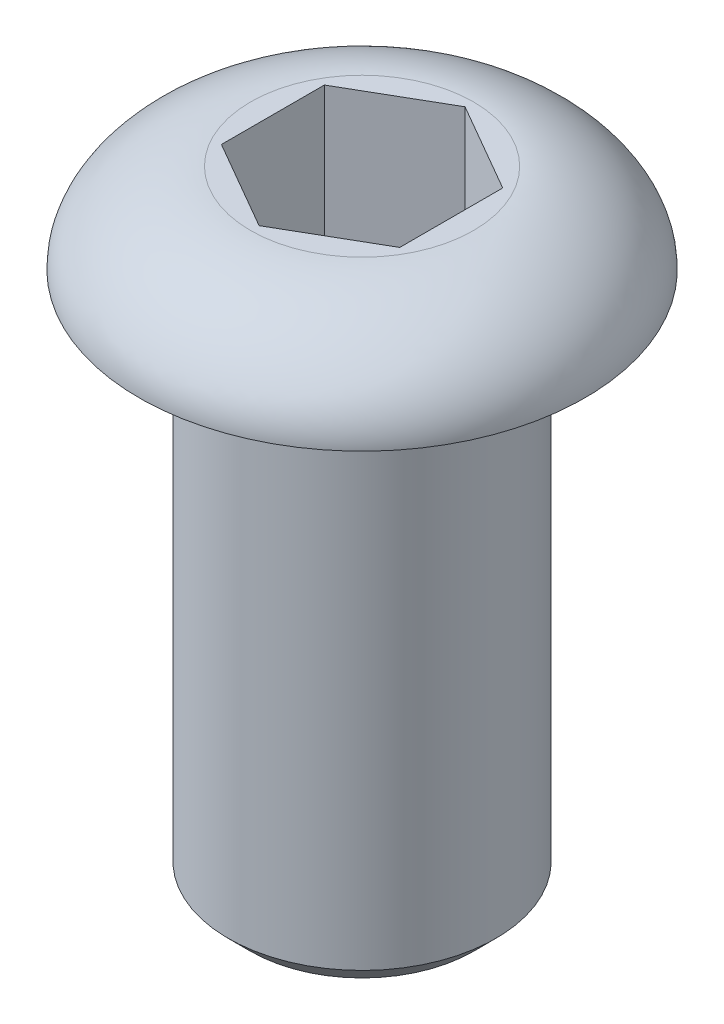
ISO-10303-21;
HEADER;
FILE_DESCRIPTION(('STEP AP214'),'2;1');
FILE_NAME('part.step','',(''),(''),'','','');
FILE_SCHEMA(('AUTOMOTIVE_DESIGN { 1 0 10303 214 1 1 1 1 }'));
ENDSEC;
DATA;
#1=APPLICATION_CONTEXT('core data for automotive mechanical design processes');
#2=APPLICATION_PROTOCOL_DEFINITION('international standard','automotive_design',2000,#1);
#3=PRODUCT_CONTEXT('',#1,'mechanical');
#4=PRODUCT('Part','Part','',(#3));
#5=PRODUCT_RELATED_PRODUCT_CATEGORY('part','',(#4));
#6=PRODUCT_DEFINITION_FORMATION('','',#4);
#7=PRODUCT_DEFINITION_CONTEXT('part definition',#1,'design');
#8=PRODUCT_DEFINITION('design','',#6,#7);
#9=PRODUCT_DEFINITION_SHAPE('','',#8);
#10=(LENGTH_UNIT() NAMED_UNIT(*) SI_UNIT(.MILLI.,.METRE.));
#11=(NAMED_UNIT(*) PLANE_ANGLE_UNIT() SI_UNIT($,.RADIAN.));
#12=(NAMED_UNIT(*) SI_UNIT($,.STERADIAN.) SOLID_ANGLE_UNIT());
#13=UNCERTAINTY_MEASURE_WITH_UNIT(LENGTH_MEASURE(1.E-05),#10,'distance_accuracy_value','');
#14=(GEOMETRIC_REPRESENTATION_CONTEXT(3) GLOBAL_UNCERTAINTY_ASSIGNED_CONTEXT((#13)) GLOBAL_UNIT_ASSIGNED_CONTEXT((#10,
#11,#12)) REPRESENTATION_CONTEXT('',''));
#15=CARTESIAN_POINT('',(0.,0.,0.));
#16=DIRECTION('',(0.,0.,1.));
#17=DIRECTION('',(1.,0.,0.));
#18=AXIS2_PLACEMENT_3D('',#15,#16,#17);
#19=CARTESIAN_POINT('',(0.,-12.,0.));
#20=DIRECTION('',(0.,1.,0.));
#21=DIRECTION('',(-1.,0.,0.));
#22=AXIS2_PLACEMENT_3D('',#19,#20,#21);
#23=PLANE('',#22);
#24=CARTESIAN_POINT('',(0.,-12.,0.));
#25=DIRECTION('',(0.,1.,0.));
#26=DIRECTION('',(-1.,0.,0.));
#27=AXIS2_PLACEMENT_3D('',#24,#25,#26);
#28=CIRCLE('',#27,2.5);
#29=CARTESIAN_POINT('',(-2.5,-12.,0.));
#30=VERTEX_POINT('',#29);
#31=EDGE_CURVE('E11',#30,#30,#28,.T.);
#32=ORIENTED_EDGE('',*,*,#31,.F.);
#33=EDGE_LOOP('',(#32));
#34=FACE_BOUND('',#33,.T.);
#35=ADVANCED_FACE('F46',(#34),#23,.F.);
#36=CARTESIAN_POINT('',(0.,-12.,0.));
#37=DIRECTION('',(0.,1.,0.));
#38=DIRECTION('',(-1.,0.,0.));
#39=AXIS2_PLACEMENT_3D('',#36,#37,#38);
#40=CONICAL_SURFACE('',#39,2.5,0.785398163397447);
#41=CARTESIAN_POINT('',(0.,-11.5,0.));
#42=DIRECTION('',(0.,1.,0.));
#43=DIRECTION('',(-1.,0.,0.));
#44=AXIS2_PLACEMENT_3D('',#41,#42,#43);
#45=CIRCLE('',#44,3.);
#46=CARTESIAN_POINT('',(-3.,-11.5,0.));
#47=VERTEX_POINT('',#46);
#48=EDGE_CURVE('E54',#47,#47,#45,.T.);
#49=ORIENTED_EDGE('',*,*,#48,.F.);
#50=EDGE_LOOP('',(#49));
#51=FACE_BOUND('',#50,.T.);
#52=ORIENTED_EDGE('',*,*,#31,.T.);
#53=EDGE_LOOP('',(#52));
#54=FACE_BOUND('',#53,.T.);
#55=ADVANCED_FACE('F196',(#51,#54),#40,.T.);
#56=CARTESIAN_POINT('',(0.,2.,0.));
#57=DIRECTION('',(0.,1.,0.));
#58=DIRECTION('',(-1.,0.,0.));
#59=AXIS2_PLACEMENT_3D('',#56,#57,#58);
#60=CYLINDRICAL_SURFACE('',#59,3.);
#61=CARTESIAN_POINT('',(0.,0.,0.));
#62=DIRECTION('',(0.,1.,0.));
#63=DIRECTION('',(-1.,0.,0.));
#64=AXIS2_PLACEMENT_3D('',#61,#62,#63);
#65=CIRCLE('',#64,3.);
#66=CARTESIAN_POINT('',(-3.,0.,0.));
#67=VERTEX_POINT('',#66);
#68=EDGE_CURVE('E210',#67,#67,#65,.T.);
#69=ORIENTED_EDGE('',*,*,#68,.F.);
#70=EDGE_LOOP('',(#69));
#71=FACE_BOUND('',#70,.T.);
#72=ORIENTED_EDGE('',*,*,#48,.T.);
#73=EDGE_LOOP('',(#72));
#74=FACE_BOUND('',#73,.T.);
#75=ADVANCED_FACE('F193',(#71,#74),#60,.T.);
#76=CARTESIAN_POINT('',(3.,0.,0.));
#77=DIRECTION('',(0.,1.,0.));
#78=DIRECTION('',(-1.,0.,0.));
#79=AXIS2_PLACEMENT_3D('',#76,#77,#78);
#80=PLANE('',#79);
#81=CARTESIAN_POINT('',(0.,0.,0.));
#82=DIRECTION('',(0.,1.,0.));
#83=DIRECTION('',(-1.,0.,0.));
#84=AXIS2_PLACEMENT_3D('',#81,#82,#83);
#85=CIRCLE('',#84,5.);
#86=CARTESIAN_POINT('',(-5.,0.,0.));
#87=VERTEX_POINT('',#86);
#88=EDGE_CURVE('E215',#87,#87,#85,.T.);
#89=ORIENTED_EDGE('',*,*,#88,.F.);
#90=EDGE_LOOP('',(#89));
#91=FACE_BOUND('',#90,.T.);
#92=ORIENTED_EDGE('',*,*,#68,.T.);
#93=EDGE_LOOP('',(#92));
#94=FACE_BOUND('',#93,.T.);
#95=ADVANCED_FACE('F188',(#91,#94),#80,.F.);
#96=CARTESIAN_POINT('',(5.,0.,0.));
#97=CARTESIAN_POINT('',(5.,1.06718737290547,0.));
#98=CARTESIAN_POINT('',(3.56718737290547,2.,0.));
#99=CARTESIAN_POINT('',(2.5,2.,0.));
#100=B_SPLINE_CURVE_WITH_KNOTS('',3,(#96,#97,#98,#99),.UNSPECIFIED.,.F.,.F.,(4,4),(0.,1.),.UNSPECIFIED.);
#101=CARTESIAN_POINT('',(0.,2.,0.));
#102=DIRECTION('',(0.,1.,0.));
#103=AXIS1_PLACEMENT('',#101,#102);
#104=SURFACE_OF_REVOLUTION('',#100,#103);
#105=CARTESIAN_POINT('',(0.,2.,0.));
#106=DIRECTION('',(0.,1.,0.));
#107=DIRECTION('',(-1.,0.,0.));
#108=AXIS2_PLACEMENT_3D('',#105,#106,#107);
#109=CIRCLE('',#108,2.5);
#110=CARTESIAN_POINT('',(-2.5,2.,0.));
#111=VERTEX_POINT('',#110);
#112=EDGE_CURVE('E164',#111,#111,#109,.T.);
#113=ORIENTED_EDGE('',*,*,#112,.F.);
#114=EDGE_LOOP('',(#113));
#115=FACE_BOUND('',#114,.T.);
#116=ORIENTED_EDGE('',*,*,#88,.T.);
#117=EDGE_LOOP('',(#116));
#118=FACE_BOUND('',#117,.T.);
#119=ADVANCED_FACE('F184',(#115,#118),#104,.T.);
#120=CARTESIAN_POINT('',(0.,2.,0.));
#121=DIRECTION('',(0.,-1.,0.));
#122=DIRECTION('',(1.,0.,0.));
#123=AXIS2_PLACEMENT_3D('',#120,#121,#122);
#124=PLANE('',#123);
#125=DIRECTION('',(0.866025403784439,0.,-0.5));
#126=VECTOR('',#125,1.);
#127=CARTESIAN_POINT('',(0.,2.,2.3094010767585));
#128=LINE('',#127,#126);
#129=CARTESIAN_POINT('',(0.,2.,2.3094010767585));
#130=VERTEX_POINT('',#129);
#131=CARTESIAN_POINT('',(2.,2.,1.15470053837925));
#132=VERTEX_POINT('',#131);
#133=EDGE_CURVE('E116',#130,#132,#128,.T.);
#134=ORIENTED_EDGE('',*,*,#133,.F.);
#135=DIRECTION('',(0.866025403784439,0.,0.5));
#136=VECTOR('',#135,1.);
#137=CARTESIAN_POINT('',(-2.,2.,1.15470053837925));
#138=LINE('',#137,#136);
#139=CARTESIAN_POINT('',(-2.,2.,1.15470053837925));
#140=VERTEX_POINT('',#139);
#141=EDGE_CURVE('E61',#140,#130,#138,.T.);
#142=ORIENTED_EDGE('',*,*,#141,.F.);
#143=DIRECTION('',(0.,0.,1.));
#144=VECTOR('',#143,1.);
#145=CARTESIAN_POINT('',(-2.,2.,-1.15470053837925));
#146=LINE('',#145,#144);
#147=CARTESIAN_POINT('',(-2.,2.,-1.15470053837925));
#148=VERTEX_POINT('',#147);
#149=EDGE_CURVE('E138',#148,#140,#146,.T.);
#150=ORIENTED_EDGE('',*,*,#149,.F.);
#151=DIRECTION('',(-0.866025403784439,0.,0.5));
#152=VECTOR('',#151,1.);
#153=CARTESIAN_POINT('',(0.,2.,-2.3094010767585));
#154=LINE('',#153,#152);
#155=CARTESIAN_POINT('',(0.,2.,-2.3094010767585));
#156=VERTEX_POINT('',#155);
#157=EDGE_CURVE('E131',#156,#148,#154,.T.);
#158=ORIENTED_EDGE('',*,*,#157,.F.);
#159=DIRECTION('',(-0.866025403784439,0.,-0.5));
#160=VECTOR('',#159,1.);
#161=CARTESIAN_POINT('',(2.,2.,-1.15470053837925));
#162=LINE('',#161,#160);
#163=CARTESIAN_POINT('',(2.,2.,-1.15470053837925));
#164=VERTEX_POINT('',#163);
#165=EDGE_CURVE('E125',#164,#156,#162,.T.);
#166=ORIENTED_EDGE('',*,*,#165,.F.);
#167=DIRECTION('',(0.,0.,-1.));
#168=VECTOR('',#167,1.);
#169=CARTESIAN_POINT('',(2.,2.,1.15470053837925));
#170=LINE('',#169,#168);
#171=EDGE_CURVE('E104',#132,#164,#170,.T.);
#172=ORIENTED_EDGE('',*,*,#171,.F.);
#173=EDGE_LOOP('',(#134,#142,#150,#158,#166,#172));
#174=FACE_BOUND('',#173,.T.);
#175=ORIENTED_EDGE('',*,*,#112,.T.);
#176=EDGE_LOOP('',(#175));
#177=FACE_BOUND('',#176,.T.);
#178=ADVANCED_FACE('F121',(#174,#177),#124,.F.);
#179=CARTESIAN_POINT('',(-2.,-1.,1.15470053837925));
#180=DIRECTION('',(-0.5,0.,0.866025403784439));
#181=DIRECTION('',(0.866025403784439,0.,0.5));
#182=AXIS2_PLACEMENT_3D('',#179,#180,#181);
#183=PLANE('',#182);
#184=DIRECTION('',(0.,1.,0.));
#185=VECTOR('',#184,1.);
#186=CARTESIAN_POINT('',(0.,-1.,2.3094010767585));
#187=LINE('',#186,#185);
#188=CARTESIAN_POINT('',(0.,-1.,2.3094010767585));
#189=VERTEX_POINT('',#188);
#190=EDGE_CURVE('E113',#189,#130,#187,.T.);
#191=ORIENTED_EDGE('',*,*,#190,.F.);
#192=DIRECTION('',(0.866025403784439,0.,0.5));
#193=VECTOR('',#192,1.);
#194=CARTESIAN_POINT('',(-2.,-1.,1.15470053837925));
#195=LINE('',#194,#193);
#196=CARTESIAN_POINT('',(-2.,-1.,1.15470053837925));
#197=VERTEX_POINT('',#196);
#198=EDGE_CURVE('E141',#197,#189,#195,.T.);
#199=ORIENTED_EDGE('',*,*,#198,.F.);
#200=DIRECTION('',(0.,1.,0.));
#201=VECTOR('',#200,1.);
#202=CARTESIAN_POINT('',(-2.,-1.,1.15470053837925));
#203=LINE('',#202,#201);
#204=EDGE_CURVE('E68',#197,#140,#203,.T.);
#205=ORIENTED_EDGE('',*,*,#204,.T.);
#206=ORIENTED_EDGE('',*,*,#141,.T.);
#207=EDGE_LOOP('',(#191,#199,#205,#206));
#208=FACE_BOUND('',#207,.T.);
#209=ADVANCED_FACE('F229',(#208),#183,.F.);
#210=CARTESIAN_POINT('',(-2.,-1.,-1.15470053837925));
#211=DIRECTION('',(-1.,0.,0.));
#212=DIRECTION('',(0.,0.,1.));
#213=AXIS2_PLACEMENT_3D('',#210,#211,#212);
#214=PLANE('',#213);
#215=ORIENTED_EDGE('',*,*,#204,.F.);
#216=DIRECTION('',(0.,0.,1.));
#217=VECTOR('',#216,1.);
#218=CARTESIAN_POINT('',(-2.,-1.,-1.15470053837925));
#219=LINE('',#218,#217);
#220=CARTESIAN_POINT('',(-2.,-1.,-1.15470053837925));
#221=VERTEX_POINT('',#220);
#222=EDGE_CURVE('E158',#221,#197,#219,.T.);
#223=ORIENTED_EDGE('',*,*,#222,.F.);
#224=DIRECTION('',(0.,1.,0.));
#225=VECTOR('',#224,1.);
#226=CARTESIAN_POINT('',(-2.,-1.,-1.15470053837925));
#227=LINE('',#226,#225);
#228=EDGE_CURVE('E165',#221,#148,#227,.T.);
#229=ORIENTED_EDGE('',*,*,#228,.T.);
#230=ORIENTED_EDGE('',*,*,#149,.T.);
#231=EDGE_LOOP('',(#215,#223,#229,#230));
#232=FACE_BOUND('',#231,.T.);
#233=ADVANCED_FACE('F233',(#232),#214,.F.);
#234=CARTESIAN_POINT('',(0.,-1.,-2.3094010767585));
#235=DIRECTION('',(-0.5,0.,-0.866025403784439));
#236=DIRECTION('',(-0.866025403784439,0.,0.5));
#237=AXIS2_PLACEMENT_3D('',#234,#235,#236);
#238=PLANE('',#237);
#239=ORIENTED_EDGE('',*,*,#228,.F.);
#240=DIRECTION('',(-0.866025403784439,0.,0.5));
#241=VECTOR('',#240,1.);
#242=CARTESIAN_POINT('',(0.,-1.,-2.3094010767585));
#243=LINE('',#242,#241);
#244=CARTESIAN_POINT('',(0.,-1.,-2.3094010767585));
#245=VERTEX_POINT('',#244);
#246=EDGE_CURVE('E154',#245,#221,#243,.T.);
#247=ORIENTED_EDGE('',*,*,#246,.F.);
#248=DIRECTION('',(0.,1.,0.));
#249=VECTOR('',#248,1.);
#250=CARTESIAN_POINT('',(0.,-1.,-2.3094010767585));
#251=LINE('',#250,#249);
#252=EDGE_CURVE('E168',#245,#156,#251,.T.);
#253=ORIENTED_EDGE('',*,*,#252,.T.);
#254=ORIENTED_EDGE('',*,*,#157,.T.);
#255=EDGE_LOOP('',(#239,#247,#253,#254));
#256=FACE_BOUND('',#255,.T.);
#257=ADVANCED_FACE('F237',(#256),#238,.F.);
#258=CARTESIAN_POINT('',(2.,-1.,-1.15470053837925));
#259=DIRECTION('',(0.5,0.,-0.866025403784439));
#260=DIRECTION('',(-0.866025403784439,0.,-0.5));
#261=AXIS2_PLACEMENT_3D('',#258,#259,#260);
#262=PLANE('',#261);
#263=ORIENTED_EDGE('',*,*,#252,.F.);
#264=DIRECTION('',(-0.866025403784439,0.,-0.5));
#265=VECTOR('',#264,1.);
#266=CARTESIAN_POINT('',(2.,-1.,-1.15470053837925));
#267=LINE('',#266,#265);
#268=CARTESIAN_POINT('',(2.,-1.,-1.15470053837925));
#269=VERTEX_POINT('',#268);
#270=EDGE_CURVE('E150',#269,#245,#267,.T.);
#271=ORIENTED_EDGE('',*,*,#270,.F.);
#272=DIRECTION('',(0.,1.,0.));
#273=VECTOR('',#272,1.);
#274=CARTESIAN_POINT('',(2.,-1.,-1.15470053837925));
#275=LINE('',#274,#273);
#276=EDGE_CURVE('E112',#269,#164,#275,.T.);
#277=ORIENTED_EDGE('',*,*,#276,.T.);
#278=ORIENTED_EDGE('',*,*,#165,.T.);
#279=EDGE_LOOP('',(#263,#271,#277,#278));
#280=FACE_BOUND('',#279,.T.);
#281=ADVANCED_FACE('F245',(#280),#262,.F.);
#282=CARTESIAN_POINT('',(2.,-1.,1.15470053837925));
#283=DIRECTION('',(1.,0.,0.));
#284=DIRECTION('',(0.,0.,-1.));
#285=AXIS2_PLACEMENT_3D('',#282,#283,#284);
#286=PLANE('',#285);
#287=ORIENTED_EDGE('',*,*,#276,.F.);
#288=DIRECTION('',(0.,0.,-1.));
#289=VECTOR('',#288,1.);
#290=CARTESIAN_POINT('',(2.,-1.,1.15470053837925));
#291=LINE('',#290,#289);
#292=CARTESIAN_POINT('',(2.,-1.,1.15470053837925));
#293=VERTEX_POINT('',#292);
#294=EDGE_CURVE('E107',#293,#269,#291,.T.);
#295=ORIENTED_EDGE('',*,*,#294,.F.);
#296=DIRECTION('',(0.,1.,0.));
#297=VECTOR('',#296,1.);
#298=CARTESIAN_POINT('',(2.,-1.,1.15470053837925));
#299=LINE('',#298,#297);
#300=EDGE_CURVE('E100',#293,#132,#299,.T.);
#301=ORIENTED_EDGE('',*,*,#300,.T.);
#302=ORIENTED_EDGE('',*,*,#171,.T.);
#303=EDGE_LOOP('',(#287,#295,#301,#302));
#304=FACE_BOUND('',#303,.T.);
#305=ADVANCED_FACE('F102',(#304),#286,.F.);
#306=CARTESIAN_POINT('',(0.,-1.,2.3094010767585));
#307=DIRECTION('',(0.5,0.,0.866025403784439));
#308=DIRECTION('',(0.866025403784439,0.,-0.5));
#309=AXIS2_PLACEMENT_3D('',#306,#307,#308);
#310=PLANE('',#309);
#311=ORIENTED_EDGE('',*,*,#300,.F.);
#312=DIRECTION('',(0.866025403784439,0.,-0.5));
#313=VECTOR('',#312,1.);
#314=CARTESIAN_POINT('',(0.,-1.,2.3094010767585));
#315=LINE('',#314,#313);
#316=EDGE_CURVE('E145',#189,#293,#315,.T.);
#317=ORIENTED_EDGE('',*,*,#316,.F.);
#318=ORIENTED_EDGE('',*,*,#190,.T.);
#319=ORIENTED_EDGE('',*,*,#133,.T.);
#320=EDGE_LOOP('',(#311,#317,#318,#319));
#321=FACE_BOUND('',#320,.T.);
#322=ADVANCED_FACE('F117',(#321),#310,.F.);
#323=CARTESIAN_POINT('',(0.,-1.,0.));
#324=DIRECTION('',(0.,1.,0.));
#325=DIRECTION('',(0.,0.,1.));
#326=AXIS2_PLACEMENT_3D('',#323,#324,#325);
#327=PLANE('',#326);
#328=ORIENTED_EDGE('',*,*,#198,.T.);
#329=ORIENTED_EDGE('',*,*,#316,.T.);
#330=ORIENTED_EDGE('',*,*,#294,.T.);
#331=ORIENTED_EDGE('',*,*,#270,.T.);
#332=ORIENTED_EDGE('',*,*,#246,.T.);
#333=ORIENTED_EDGE('',*,*,#222,.T.);
#334=EDGE_LOOP('',(#328,#329,#330,#331,#332,#333));
#335=FACE_BOUND('',#334,.T.);
#336=ADVANCED_FACE('F242',(#335),#327,.T.);
#337=CLOSED_SHELL('',(#35,#55,#75,#95,#119,#178,#209,#233,#257,#281,#305,#322,#336));
#338=MANIFOLD_SOLID_BREP('B2',#337);
#339=ADVANCED_BREP_SHAPE_REPRESENTATION('',(#18,#338),#14);
#340=SHAPE_DEFINITION_REPRESENTATION(#9,#339);
ENDSEC;
END-ISO-10303-21;
